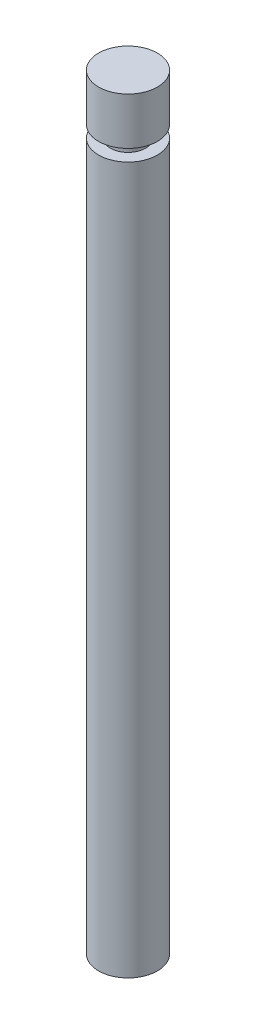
ISO-10303-21;
HEADER;
FILE_DESCRIPTION(('STEP AP214'),'2;1');
FILE_NAME('part.step','',(''),(''),'','','');
FILE_SCHEMA(('AUTOMOTIVE_DESIGN { 1 0 10303 214 1 1 1 1 }'));
ENDSEC;
DATA;
#1=APPLICATION_CONTEXT('core data for automotive mechanical design processes');
#2=APPLICATION_PROTOCOL_DEFINITION('international standard','automotive_design',2000,#1);
#3=PRODUCT_CONTEXT('',#1,'mechanical');
#4=PRODUCT('Part','Part','',(#3));
#5=PRODUCT_RELATED_PRODUCT_CATEGORY('part','',(#4));
#6=PRODUCT_DEFINITION_FORMATION('','',#4);
#7=PRODUCT_DEFINITION_CONTEXT('part definition',#1,'design');
#8=PRODUCT_DEFINITION('design','',#6,#7);
#9=PRODUCT_DEFINITION_SHAPE('','',#8);
#10=(LENGTH_UNIT() NAMED_UNIT(*) SI_UNIT(.MILLI.,.METRE.));
#11=(NAMED_UNIT(*) PLANE_ANGLE_UNIT() SI_UNIT($,.RADIAN.));
#12=(NAMED_UNIT(*) SI_UNIT($,.STERADIAN.) SOLID_ANGLE_UNIT());
#13=UNCERTAINTY_MEASURE_WITH_UNIT(LENGTH_MEASURE(1.E-05),#10,'distance_accuracy_value','');
#14=(GEOMETRIC_REPRESENTATION_CONTEXT(3) GLOBAL_UNCERTAINTY_ASSIGNED_CONTEXT((#13)) GLOBAL_UNIT_ASSIGNED_CONTEXT((#10,
#11,#12)) REPRESENTATION_CONTEXT('',''));
#15=CARTESIAN_POINT('',(0.,0.,0.));
#16=DIRECTION('',(0.,0.,1.));
#17=DIRECTION('',(1.,0.,0.));
#18=AXIS2_PLACEMENT_3D('',#15,#16,#17);
#19=CARTESIAN_POINT('',(0.,38.1,0.));
#20=DIRECTION('',(0.,1.,0.));
#21=DIRECTION('',(0.,0.,1.));
#22=AXIS2_PLACEMENT_3D('',#19,#20,#21);
#23=PLANE('',#22);
#24=CARTESIAN_POINT('',(0.,38.1,0.));
#25=DIRECTION('',(0.,1.,0.));
#26=DIRECTION('',(0.,0.,1.));
#27=AXIS2_PLACEMENT_3D('',#24,#25,#26);
#28=CIRCLE('',#27,1.5875);
#29=CARTESIAN_POINT('',(0.,38.1,-1.5875));
#30=VERTEX_POINT('',#29);
#31=EDGE_CURVE('E10',#30,#30,#28,.T.);
#32=ORIENTED_EDGE('',*,*,#31,.T.);
#33=EDGE_LOOP('',(#32));
#34=FACE_BOUND('',#33,.T.);
#35=CARTESIAN_POINT('',(0.,38.1,0.));
#36=DIRECTION('',(0.,1.,0.));
#37=DIRECTION('',(0.,0.,1.));
#38=AXIS2_PLACEMENT_3D('',#35,#36,#37);
#39=CIRCLE('',#38,0.9525);
#40=CARTESIAN_POINT('',(0.,38.1,0.9525));
#41=VERTEX_POINT('',#40);
#42=EDGE_CURVE('E43',#41,#41,#39,.T.);
#43=ORIENTED_EDGE('',*,*,#42,.F.);
#44=EDGE_LOOP('',(#43));
#45=FACE_BOUND('',#44,.T.);
#46=ADVANCED_FACE('F30',(#34,#45),#23,.T.);
#47=CARTESIAN_POINT('',(0.,38.1,0.));
#48=DIRECTION('',(0.,-1.,0.));
#49=DIRECTION('',(0.,0.,-1.));
#50=AXIS2_PLACEMENT_3D('',#47,#48,#49);
#51=CYLINDRICAL_SURFACE('',#50,1.5875);
#52=CARTESIAN_POINT('',(0.,0.,0.));
#53=DIRECTION('',(0.,1.,0.));
#54=DIRECTION('',(0.,0.,1.));
#55=AXIS2_PLACEMENT_3D('',#52,#53,#54);
#56=CIRCLE('',#55,1.5875);
#57=CARTESIAN_POINT('',(0.,0.,-1.5875));
#58=VERTEX_POINT('',#57);
#59=EDGE_CURVE('E34',#58,#58,#56,.T.);
#60=CARTESIAN_POINT('',(0.,38.1,-1.5875));
#61=CARTESIAN_POINT('',(0.,37.703125,-1.5875));
#62=CARTESIAN_POINT('',(0.,37.30625,-1.5875));
#63=CARTESIAN_POINT('',(0.,36.5125,-1.5875));
#64=CARTESIAN_POINT('',(0.,36.115625,-1.5875));
#65=CARTESIAN_POINT('',(0.,35.321875,-1.5875));
#66=CARTESIAN_POINT('',(0.,34.925,-1.5875));
#67=CARTESIAN_POINT('',(0.,34.13125,-1.5875));
#68=CARTESIAN_POINT('',(0.,33.734375,-1.5875));
#69=CARTESIAN_POINT('',(0.,32.940625,-1.5875));
#70=CARTESIAN_POINT('',(0.,32.54375,-1.5875));
#71=CARTESIAN_POINT('',(0.,31.75,-1.5875));
#72=CARTESIAN_POINT('',(0.,31.353125,-1.5875));
#73=CARTESIAN_POINT('',(0.,30.559375,-1.5875));
#74=CARTESIAN_POINT('',(0.,30.1625,-1.5875));
#75=CARTESIAN_POINT('',(0.,29.36875,-1.5875));
#76=CARTESIAN_POINT('',(0.,28.971875,-1.5875));
#77=CARTESIAN_POINT('',(0.,28.178125,-1.5875));
#78=CARTESIAN_POINT('',(0.,27.78125,-1.5875));
#79=CARTESIAN_POINT('',(0.,26.9875,-1.5875));
#80=CARTESIAN_POINT('',(0.,26.590625,-1.5875));
#81=CARTESIAN_POINT('',(0.,25.796875,-1.5875));
#82=CARTESIAN_POINT('',(0.,25.4,-1.5875));
#83=CARTESIAN_POINT('',(0.,24.60625,-1.5875));
#84=CARTESIAN_POINT('',(0.,24.209375,-1.5875));
#85=CARTESIAN_POINT('',(0.,23.415625,-1.5875));
#86=CARTESIAN_POINT('',(0.,23.01875,-1.5875));
#87=CARTESIAN_POINT('',(0.,22.225,-1.5875));
#88=CARTESIAN_POINT('',(0.,21.828125,-1.5875));
#89=CARTESIAN_POINT('',(0.,21.034375,-1.5875));
#90=CARTESIAN_POINT('',(0.,20.6375,-1.5875));
#91=CARTESIAN_POINT('',(0.,19.84375,-1.5875));
#92=CARTESIAN_POINT('',(0.,19.446875,-1.5875));
#93=CARTESIAN_POINT('',(0.,18.653125,-1.5875));
#94=CARTESIAN_POINT('',(0.,18.25625,-1.5875));
#95=CARTESIAN_POINT('',(0.,17.4625,-1.5875));
#96=CARTESIAN_POINT('',(0.,17.065625,-1.5875));
#97=CARTESIAN_POINT('',(0.,16.271875,-1.5875));
#98=CARTESIAN_POINT('',(0.,15.875,-1.5875));
#99=CARTESIAN_POINT('',(0.,15.08125,-1.5875));
#100=CARTESIAN_POINT('',(0.,14.684375,-1.5875));
#101=CARTESIAN_POINT('',(0.,13.890625,-1.5875));
#102=CARTESIAN_POINT('',(0.,13.49375,-1.5875));
#103=CARTESIAN_POINT('',(0.,12.7,-1.5875));
#104=CARTESIAN_POINT('',(0.,12.303125,-1.5875));
#105=CARTESIAN_POINT('',(0.,11.509375,-1.5875));
#106=CARTESIAN_POINT('',(0.,11.1125,-1.5875));
#107=CARTESIAN_POINT('',(0.,10.31875,-1.5875));
#108=CARTESIAN_POINT('',(0.,9.92187499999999,-1.5875));
#109=CARTESIAN_POINT('',(0.,9.128125,-1.5875));
#110=CARTESIAN_POINT('',(0.,8.73124999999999,-1.5875));
#111=CARTESIAN_POINT('',(0.,7.93749999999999,-1.5875));
#112=CARTESIAN_POINT('',(0.,7.54062499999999,-1.5875));
#113=CARTESIAN_POINT('',(0.,6.746875,-1.5875));
#114=CARTESIAN_POINT('',(0.,6.35,-1.5875));
#115=CARTESIAN_POINT('',(0.,5.55625,-1.5875));
#116=CARTESIAN_POINT('',(0.,5.159375,-1.5875));
#117=CARTESIAN_POINT('',(0.,4.365625,-1.5875));
#118=CARTESIAN_POINT('',(0.,3.96875,-1.5875));
#119=CARTESIAN_POINT('',(0.,3.175,-1.5875));
#120=CARTESIAN_POINT('',(0.,2.778125,-1.5875));
#121=CARTESIAN_POINT('',(0.,1.984375,-1.5875));
#122=CARTESIAN_POINT('',(0.,1.5875,-1.5875));
#123=CARTESIAN_POINT('',(0.,0.79375,-1.5875));
#124=CARTESIAN_POINT('',(0.,0.396875,-1.5875));
#125=CARTESIAN_POINT('',(0.,0.,-1.5875));
#126=B_SPLINE_CURVE_WITH_KNOTS('',3,(#60,#61,#62,#63,#64,#65,#66,#67,#68,#69,#70,#71,#72,#73,
#74,#75,#76,#77,#78,#79,#80,#81,#82,#83,#84,#85,#86,#87,#88,#89,#90,#91,#92,#93,#94,#95,#96,#97,
#98,#99,#100,#101,#102,#103,#104,#105,#106,#107,#108,#109,#110,#111,#112,#113,#114,#115,#116,
#117,#118,#119,#120,#121,#122,#123,#124,#125),.UNSPECIFIED.,.F.,.F.,(4,2,2,2,2,2,2,2,2,2,2,2,2,
2,2,2,2,2,2,2,2,2,2,2,2,2,2,2,2,2,2,2,4),(0.,1.190625,2.38125,3.571875,4.7625,5.953125,7.14375,
8.334375,9.52500000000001,10.715625,11.90625,13.096875,14.2875,15.478125,16.66875,17.859375,
19.05,20.240625,21.43125,22.621875,23.8125,25.003125,26.19375,27.384375,28.575,29.765625,
30.95625,32.146875,33.3375,34.528125,35.71875,36.909375,38.1),.UNSPECIFIED.);
#127=EDGE_CURVE('BSEAM32',#30,#58,#126,.T.);
#128=ORIENTED_EDGE('',*,*,#31,.F.);
#129=ORIENTED_EDGE('',*,*,#59,.T.);
#130=ORIENTED_EDGE('',*,*,#127,.T.);
#131=ORIENTED_EDGE('',*,*,#127,.F.);
#132=EDGE_LOOP('',(#128,#130,#129,#131));
#133=FACE_BOUND('',#132,.T.);
#134=ADVANCED_FACE('F32',(#133),#51,.T.);
#135=CARTESIAN_POINT('',(0.,0.,0.));
#136=DIRECTION('',(0.,1.,0.));
#137=DIRECTION('',(0.,0.,1.));
#138=AXIS2_PLACEMENT_3D('',#135,#136,#137);
#139=PLANE('',#138);
#140=ORIENTED_EDGE('',*,*,#59,.F.);
#141=EDGE_LOOP('',(#140));
#142=FACE_BOUND('',#141,.T.);
#143=ADVANCED_FACE('F72',(#142),#139,.F.);
#144=CARTESIAN_POINT('',(0.,38.735,0.));
#145=DIRECTION('',(0.,-1.,0.));
#146=DIRECTION('',(0.,0.,-1.));
#147=AXIS2_PLACEMENT_3D('',#144,#145,#146);
#148=CYLINDRICAL_SURFACE('',#147,0.9525);
#149=CARTESIAN_POINT('',(0.,38.735,0.));
#150=DIRECTION('',(0.,1.,0.));
#151=DIRECTION('',(0.,0.,1.));
#152=AXIS2_PLACEMENT_3D('',#149,#150,#151);
#153=CIRCLE('',#152,0.9525);
#154=CARTESIAN_POINT('',(0.,38.735,0.9525));
#155=VERTEX_POINT('',#154);
#156=EDGE_CURVE('E41',#155,#155,#153,.T.);
#157=ORIENTED_EDGE('',*,*,#156,.F.);
#158=EDGE_LOOP('',(#157));
#159=FACE_BOUND('',#158,.T.);
#160=ORIENTED_EDGE('',*,*,#42,.T.);
#161=EDGE_LOOP('',(#160));
#162=FACE_BOUND('',#161,.T.);
#163=ADVANCED_FACE('F66',(#159,#162),#148,.T.);
#164=CARTESIAN_POINT('',(0.,38.735,0.));
#165=DIRECTION('',(0.,1.,0.));
#166=DIRECTION('',(0.,0.,1.));
#167=AXIS2_PLACEMENT_3D('',#164,#165,#166);
#168=PLANE('',#167);
#169=CARTESIAN_POINT('',(0.,38.735,0.));
#170=DIRECTION('',(0.,1.,0.));
#171=DIRECTION('',(0.,0.,1.));
#172=AXIS2_PLACEMENT_3D('',#169,#170,#171);
#173=CIRCLE('',#172,1.5875);
#174=CARTESIAN_POINT('',(0.,38.735,1.5875));
#175=VERTEX_POINT('',#174);
#176=EDGE_CURVE('E49',#175,#175,#173,.T.);
#177=ORIENTED_EDGE('',*,*,#176,.F.);
#178=EDGE_LOOP('',(#177));
#179=FACE_BOUND('',#178,.T.);
#180=ORIENTED_EDGE('',*,*,#156,.T.);
#181=EDGE_LOOP('',(#180));
#182=FACE_BOUND('',#181,.T.);
#183=ADVANCED_FACE('F60',(#179,#182),#168,.F.);
#184=CARTESIAN_POINT('',(0.,41.275,0.));
#185=DIRECTION('',(0.,-1.,0.));
#186=DIRECTION('',(0.,0.,-1.));
#187=AXIS2_PLACEMENT_3D('',#184,#185,#186);
#188=CYLINDRICAL_SURFACE('',#187,1.5875);
#189=CARTESIAN_POINT('',(0.,41.275,0.));
#190=DIRECTION('',(0.,1.,0.));
#191=DIRECTION('',(0.,0.,1.));
#192=AXIS2_PLACEMENT_3D('',#189,#190,#191);
#193=CIRCLE('',#192,1.5875);
#194=CARTESIAN_POINT('',(0.,41.275,1.5875));
#195=VERTEX_POINT('',#194);
#196=EDGE_CURVE('E46',#195,#195,#193,.T.);
#197=ORIENTED_EDGE('',*,*,#196,.F.);
#198=EDGE_LOOP('',(#197));
#199=FACE_BOUND('',#198,.T.);
#200=ORIENTED_EDGE('',*,*,#176,.T.);
#201=EDGE_LOOP('',(#200));
#202=FACE_BOUND('',#201,.T.);
#203=ADVANCED_FACE('F57',(#199,#202),#188,.T.);
#204=CARTESIAN_POINT('',(0.,41.275,0.));
#205=DIRECTION('',(0.,1.,0.));
#206=DIRECTION('',(0.,0.,1.));
#207=AXIS2_PLACEMENT_3D('',#204,#205,#206);
#208=PLANE('',#207);
#209=ORIENTED_EDGE('',*,*,#196,.T.);
#210=EDGE_LOOP('',(#209));
#211=FACE_BOUND('',#210,.T.);
#212=ADVANCED_FACE('F55',(#211),#208,.T.);
#213=CLOSED_SHELL('',(#46,#134,#143,#163,#183,#203,#212));
#214=MANIFOLD_SOLID_BREP('B2',#213);
#215=ADVANCED_BREP_SHAPE_REPRESENTATION('',(#18,#214),#14);
#216=SHAPE_DEFINITION_REPRESENTATION(#9,#215);
ENDSEC;
END-ISO-10303-21;
